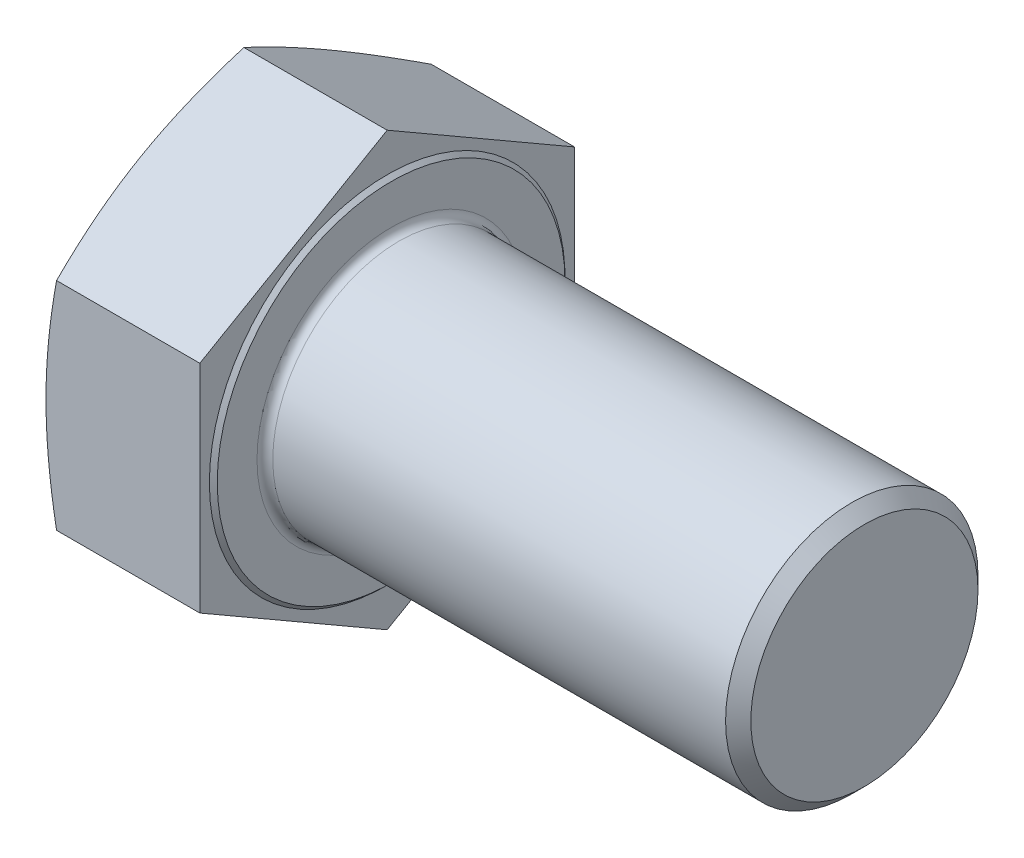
from build123d import *

# Parameters (mm, degrees)
BASEHEAD_DEPTH = 40
SKETCH5_R      = 32
BASEBODY_DEPTH = 120
CHAMFER1_SIZE  = 3.2
HEADFILLET_R   = 2


with BuildPart() as part:
    # Sketch2 → BaseHead (new body)
    with BuildSketch(Plane(origin=(0, 0, 0), x_dir=(0, 0, -1), z_dir=(1, 0, 0))):
        Polygon((0, -54.848275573), (47.5, -27.424137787), (47.5, 27.424137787), (0, 54.848275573), (-47.5, 27.424137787), (-47.5, -27.424137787), align=None)
    extrude(amount=BASEHEAD_DEPTH)

    # Sketch3 → BearingFace (revolve, cut)
    with BuildSketch(Plane.XY, mode=Mode.PRIVATE) as bearingface_sk:
        Polygon((40, 54.848275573), (40, 44.08), (39, 45.08), (39, 54.848275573), align=None)
    revolve(bearingface_sk.sketch.rotate(Axis((-0.957090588, 0, 0), (1, 0, 0)), 90), axis=Axis((-0.957090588, 0, 0), (1, 0, 0)), mode=Mode.SUBTRACT)

    # Sketch4 → HeadChamfer (revolve, cut)
    with BuildSketch(Plane.XY):
        Polygon((0, 54.848275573), (2.674553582, 54.848275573), (0, 47.5), align=None)
    revolve(axis=Axis((-0.493528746, 0, 0), (1, 0, 0)), mode=Mode.SUBTRACT)

    # Sketch5 → BaseBody (add)
    with BuildSketch(Plane(origin=(40, 0, 0), x_dir=(0, 0, -1), z_dir=(1, 0, 0))):
        Circle(SKETCH5_R)
    extrude(amount=BASEBODY_DEPTH)

    # Chamfer1
    chamfer1_edges = [part.edges().sort_by_distance(p)[0] for p in [
        (160, 0, 32),
    ]]
    chamfer(chamfer1_edges, length=CHAMFER1_SIZE)

    # HeadFillet
    headfillet_edges = [part.edges().sort_by_distance(p)[0] for p in [
        (40, 0, 32),
    ]]
    fillet(headfillet_edges, radius=HEADFILLET_R)


solid = part.part
